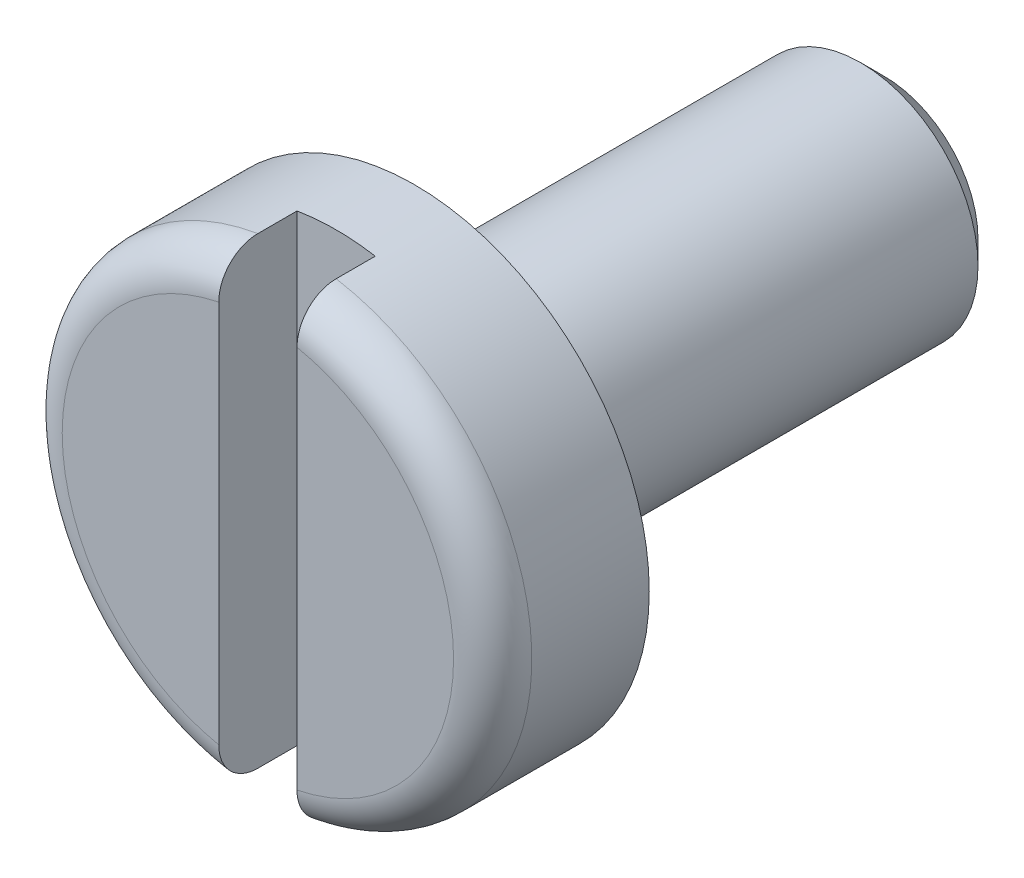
ISO-10303-21;
HEADER;
FILE_DESCRIPTION(('STEP AP214'),'2;1');
FILE_NAME('part.step','',(''),(''),'','','');
FILE_SCHEMA(('AUTOMOTIVE_DESIGN { 1 0 10303 214 1 1 1 1 }'));
ENDSEC;
DATA;
#1=APPLICATION_CONTEXT('core data for automotive mechanical design processes');
#2=APPLICATION_PROTOCOL_DEFINITION('international standard','automotive_design',2000,#1);
#3=PRODUCT_CONTEXT('',#1,'mechanical');
#4=PRODUCT('Part','Part','',(#3));
#5=PRODUCT_RELATED_PRODUCT_CATEGORY('part','',(#4));
#6=PRODUCT_DEFINITION_FORMATION('','',#4);
#7=PRODUCT_DEFINITION_CONTEXT('part definition',#1,'design');
#8=PRODUCT_DEFINITION('design','',#6,#7);
#9=PRODUCT_DEFINITION_SHAPE('','',#8);
#10=(LENGTH_UNIT() NAMED_UNIT(*) SI_UNIT(.MILLI.,.METRE.));
#11=(NAMED_UNIT(*) PLANE_ANGLE_UNIT() SI_UNIT($,.RADIAN.));
#12=(NAMED_UNIT(*) SI_UNIT($,.STERADIAN.) SOLID_ANGLE_UNIT());
#13=UNCERTAINTY_MEASURE_WITH_UNIT(LENGTH_MEASURE(1.E-05),#10,'distance_accuracy_value','');
#14=(GEOMETRIC_REPRESENTATION_CONTEXT(3) GLOBAL_UNCERTAINTY_ASSIGNED_CONTEXT((#13)) GLOBAL_UNIT_ASSIGNED_CONTEXT((#10,
#11,#12)) REPRESENTATION_CONTEXT('',''));
#15=CARTESIAN_POINT('',(0.,0.,0.));
#16=DIRECTION('',(0.,0.,1.));
#17=DIRECTION('',(1.,0.,0.));
#18=AXIS2_PLACEMENT_3D('',#15,#16,#17);
#19=CARTESIAN_POINT('',(0.,0.,8.));
#20=DIRECTION('',(0.,0.,1.));
#21=DIRECTION('',(1.,0.,0.));
#22=AXIS2_PLACEMENT_3D('',#19,#20,#21);
#23=PLANE('',#22);
#24=DIRECTION('',(0.,-1.,0.));
#25=VECTOR('',#24,1.);
#26=CARTESIAN_POINT('',(-0.5,3.22863713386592,8.));
#27=LINE('',#26,#25);
#28=CARTESIAN_POINT('',(-0.5,2.44948974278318,8.));
#29=VERTEX_POINT('',#28);
#30=CARTESIAN_POINT('',(-0.5,-2.44948974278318,8.));
#31=VERTEX_POINT('',#30);
#32=EDGE_CURVE('E80',#29,#31,#27,.T.);
#33=ORIENTED_EDGE('',*,*,#32,.F.);
#34=CARTESIAN_POINT('',(0.,0.,8.));
#35=DIRECTION('',(0.,0.,1.));
#36=DIRECTION('',(1.,0.,0.));
#37=AXIS2_PLACEMENT_3D('',#34,#35,#36);
#38=CIRCLE('',#37,2.5);
#39=EDGE_CURVE('E91',#29,#31,#38,.T.);
#40=ORIENTED_EDGE('',*,*,#39,.T.);
#41=EDGE_LOOP('',(#33,#40));
#42=FACE_BOUND('',#41,.T.);
#43=ADVANCED_FACE('F26',(#42),#23,.T.);
#44=CARTESIAN_POINT('',(0.,0.,7.5));
#45=DIRECTION('',(0.,0.,1.));
#46=DIRECTION('',(1.,0.,0.));
#47=AXIS2_PLACEMENT_3D('',#44,#45,#46);
#48=TOROIDAL_SURFACE('',#47,2.5,0.5);
#49=CARTESIAN_POINT('',(-0.5,-2.92910029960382,7.66648391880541));
#50=CARTESIAN_POINT('',(-0.5,-2.93844823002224,7.64038516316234));
#51=CARTESIAN_POINT('',(-0.5,-2.94560497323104,7.61348100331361));
#52=CARTESIAN_POINT('',(-0.5,-2.95530441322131,7.55883158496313));
#53=CARTESIAN_POINT('',(-0.5,-2.9578419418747,7.53108541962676));
#54=CARTESIAN_POINT('',(-0.5,-2.95821537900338,7.47557010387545));
#55=CARTESIAN_POINT('',(-0.5,-2.95605316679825,7.44780096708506));
#56=CARTESIAN_POINT('',(-0.5,-2.94709636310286,7.39302777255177));
#57=CARTESIAN_POINT('',(-0.5,-2.94030282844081,7.36602354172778));
#58=CARTESIAN_POINT('',(-0.5,-2.92229021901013,7.31353419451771));
#59=CARTESIAN_POINT('',(-0.5,-2.91107107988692,7.28804910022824));
#60=CARTESIAN_POINT('',(-0.5,-2.88454214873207,7.23930539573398));
#61=CARTESIAN_POINT('',(-0.5,-2.8692321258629,7.2160469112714));
#62=CARTESIAN_POINT('',(-0.5,-2.83484898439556,7.17223295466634));
#63=CARTESIAN_POINT('',(-0.5,-2.81574984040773,7.15169791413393));
#64=CARTESIAN_POINT('',(-0.5,-2.77441547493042,7.11407484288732));
#65=CARTESIAN_POINT('',(-0.5,-2.75218007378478,7.096987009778));
#66=CARTESIAN_POINT('',(-0.5,-2.70489167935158,7.06649491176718));
#67=CARTESIAN_POINT('',(-0.5,-2.67980509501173,7.05314275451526));
#68=CARTESIAN_POINT('',(-0.5,-2.62777294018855,7.03076231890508));
#69=CARTESIAN_POINT('',(-0.5,-2.60082721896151,7.02173439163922));
#70=CARTESIAN_POINT('',(-0.5,-2.5453693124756,7.00810295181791));
#71=CARTESIAN_POINT('',(-0.5,-2.51683867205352,7.00357451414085));
#72=CARTESIAN_POINT('',(-0.5,-2.45942117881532,6.99929807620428));
#73=CARTESIAN_POINT('',(-0.5,-2.43053429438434,6.99955050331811));
#74=CARTESIAN_POINT('',(-0.5,-2.37278535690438,7.00484798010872));
#75=CARTESIAN_POINT('',(-0.5,-2.34392957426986,7.00996155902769));
#76=CARTESIAN_POINT('',(-0.5,-2.2874751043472,7.02493432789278));
#77=CARTESIAN_POINT('',(-0.5,-2.25987649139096,7.03479379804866));
#78=CARTESIAN_POINT('',(-0.5,-2.20658588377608,7.05905829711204));
#79=CARTESIAN_POINT('',(-0.5,-2.18090412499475,7.0734858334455));
#80=CARTESIAN_POINT('',(-0.5,-2.13236000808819,7.10649188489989));
#81=CARTESIAN_POINT('',(-0.5,-2.10949757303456,7.12507028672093));
#82=CARTESIAN_POINT('',(-0.5,-2.06753180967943,7.16565875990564));
#83=CARTESIAN_POINT('',(-0.5,-2.04839034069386,7.18762935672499));
#84=CARTESIAN_POINT('',(-0.5,-2.0141846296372,7.23454496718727));
#85=CARTESIAN_POINT('',(-0.5,-1.99911975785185,7.25948952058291));
#86=CARTESIAN_POINT('',(-0.5,-1.97392316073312,7.31095624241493));
#87=CARTESIAN_POINT('',(-0.5,-1.96367361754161,7.33742071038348));
#88=CARTESIAN_POINT('',(-0.5,-1.94790406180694,7.39172254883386));
#89=CARTESIAN_POINT('',(-0.5,-1.94238316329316,7.41955966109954));
#90=CARTESIAN_POINT('',(-0.5,-1.93635623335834,7.47500517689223));
#91=CARTESIAN_POINT('',(-0.5,-1.93571821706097,7.50259929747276));
#92=CARTESIAN_POINT('',(-0.5,-1.93913162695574,7.55749434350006));
#93=CARTESIAN_POINT('',(-0.5,-1.94318271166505,7.58479529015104));
#94=CARTESIAN_POINT('',(-0.5,-1.95577233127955,7.63807658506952));
#95=CARTESIAN_POINT('',(-0.5,-1.96426975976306,7.66406667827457));
#96=CARTESIAN_POINT('',(-0.5,-1.98544238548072,7.71428359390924));
#97=CARTESIAN_POINT('',(-0.5,-1.99811784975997,7.73851030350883));
#98=CARTESIAN_POINT('',(-0.5,-2.02747185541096,7.78492736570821));
#99=CARTESIAN_POINT('',(-0.5,-2.04420914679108,7.80708052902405));
#100=CARTESIAN_POINT('',(-0.5,-2.08107095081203,7.84836082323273));
#101=CARTESIAN_POINT('',(-0.5,-2.10119592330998,7.86748754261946));
#102=CARTESIAN_POINT('',(-0.5,-2.14486992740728,7.90274203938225));
#103=CARTESIAN_POINT('',(-0.5,-2.16849950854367,7.91877004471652));
#104=CARTESIAN_POINT('',(-0.5,-2.21806540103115,7.94673839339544));
#105=CARTESIAN_POINT('',(-0.5,-2.24400201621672,7.95867819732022));
#106=CARTESIAN_POINT('',(-0.5,-2.29809760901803,7.97839941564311));
#107=CARTESIAN_POINT('',(-0.5,-2.32629423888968,7.98607768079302));
#108=CARTESIAN_POINT('',(-0.5,-2.38357319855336,7.99663397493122));
#109=CARTESIAN_POINT('',(-0.5,-2.41265558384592,7.99951170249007));
#110=CARTESIAN_POINT('',(-0.5,-2.47112566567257,8.00037745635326));
#111=CARTESIAN_POINT('',(-0.5,-2.50051395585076,7.99832656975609));
#112=CARTESIAN_POINT('',(-0.5,-2.55852063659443,7.98928463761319));
#113=CARTESIAN_POINT('',(-0.5,-2.58713907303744,7.98229388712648));
#114=CARTESIAN_POINT('',(-0.5,-2.64256911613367,7.96360640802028));
#115=CARTESIAN_POINT('',(-0.5,-2.66939218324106,7.95194370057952));
#116=CARTESIAN_POINT('',(-0.5,-2.72066329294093,7.92420874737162));
#117=CARTESIAN_POINT('',(-0.5,-2.7451109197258,7.90813573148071));
#118=CARTESIAN_POINT('',(-0.5,-2.79053500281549,7.87229330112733));
#119=CARTESIAN_POINT('',(-0.5,-2.81155761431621,7.85258232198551));
#120=CARTESIAN_POINT('',(-0.5,-2.84990593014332,7.80987278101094));
#121=CARTESIAN_POINT('',(-0.5,-2.86723646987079,7.78687858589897));
#122=CARTESIAN_POINT('',(-0.5,-2.89192637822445,7.74746372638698));
#123=CARTESIAN_POINT('',(-0.5,-2.90058016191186,7.73183834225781));
#124=CARTESIAN_POINT('',(-0.5,-2.91615865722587,7.69974783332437));
#125=CARTESIAN_POINT('',(-0.5,-2.92308338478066,7.68328271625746));
#126=CARTESIAN_POINT('',(-0.5,-2.92910029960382,7.66648391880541));
#127=B_SPLINE_CURVE_WITH_KNOTS('',3,(#49,#50,#51,#52,#53,#54,#55,#56,#57,#58,#59,#60,#61,#62,
#63,#64,#65,#66,#67,#68,#69,#70,#71,#72,#73,#74,#75,#76,#77,#78,#79,#80,#81,#82,#83,#84,#85,#86,
#87,#88,#89,#90,#91,#92,#93,#94,#95,#96,#97,#98,#99,#100,#101,#102,#103,#104,#105,#106,#107,
#108,#109,#110,#111,#112,#113,#114,#115,#116,#117,#118,#119,#120,#121,#122,#123,#124,#125,#126),
.UNSPECIFIED.,.T.,.F.,(4,2,2,2,2,2,2,2,2,2,2,2,2,2,2,2,2,2,2,2,2,2,2,2,2,2,2,2,2,2,2,2,2,2,2,2,
2,2,4),(0.,0.0831021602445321,0.166297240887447,0.249459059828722,0.332601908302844,
0.415745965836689,0.498894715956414,0.582635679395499,0.666381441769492,0.751242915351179,
0.836111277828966,0.922373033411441,1.00864250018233,1.09614645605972,1.18365557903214,
1.27160276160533,1.35954754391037,1.44653689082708,1.53351279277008,1.61823277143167,
1.70293687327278,1.7853430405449,1.86774320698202,1.94939470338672,2.03105141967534,
2.11396810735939,2.19689605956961,2.28216240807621,2.3674400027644,2.45470052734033,
2.54196653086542,2.62992378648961,2.71787578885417,2.80519864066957,2.89253675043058,
2.97857790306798,3.06450566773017,3.11799592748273,3.17148569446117),.UNSPECIFIED.);
#128=CARTESIAN_POINT('',(-0.5,-2.95803989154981,7.5));
#129=VERTEX_POINT('',#128);
#130=EDGE_CURVE('E49',#31,#129,#127,.T.);
#131=ORIENTED_EDGE('',*,*,#130,.F.);
#132=ORIENTED_EDGE('',*,*,#39,.F.);
#133=CARTESIAN_POINT('',(-0.5,1.96320130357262,7.65875486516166));
#134=CARTESIAN_POINT('',(-0.5,1.95429166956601,7.63296533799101));
#135=CARTESIAN_POINT('',(-0.5,1.94753561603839,7.60641313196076));
#136=CARTESIAN_POINT('',(-0.5,1.93857590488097,7.55253238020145));
#137=CARTESIAN_POINT('',(-0.5,1.93637654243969,7.52520312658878));
#138=CARTESIAN_POINT('',(-0.5,1.93661602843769,7.47057033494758));
#139=CARTESIAN_POINT('',(-0.5,1.93905361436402,7.44326679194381));
#140=CARTESIAN_POINT('',(-0.5,1.94847883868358,7.38946388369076));
#141=CARTESIAN_POINT('',(-0.5,1.95546570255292,7.36296438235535));
#142=CARTESIAN_POINT('',(-0.5,1.97375330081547,7.31148810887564));
#143=CARTESIAN_POINT('',(-0.5,1.98505592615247,7.28651200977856));
#144=CARTESIAN_POINT('',(-0.5,2.0116085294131,7.23875570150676));
#145=CARTESIAN_POINT('',(-0.5,2.02685897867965,7.21597575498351));
#146=CARTESIAN_POINT('',(-0.5,2.06121064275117,7.17272543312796));
#147=CARTESIAN_POINT('',(-0.5,2.08038762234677,7.15231526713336));
#148=CARTESIAN_POINT('',(-0.5,2.12181138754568,7.1148940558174));
#149=CARTESIAN_POINT('',(-0.5,2.14405861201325,7.09788349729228));
#150=CARTESIAN_POINT('',(-0.5,2.19167170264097,7.06724341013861));
#151=CARTESIAN_POINT('',(-0.5,2.21710813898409,7.05372349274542));
#152=CARTESIAN_POINT('',(-0.5,2.26985957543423,7.03105400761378));
#153=CARTESIAN_POINT('',(-0.5,2.29717478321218,7.02190492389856));
#154=CARTESIAN_POINT('',(-0.5,2.35346332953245,7.00808482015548));
#155=CARTESIAN_POINT('',(-0.5,2.38245820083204,7.00350132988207));
#156=CARTESIAN_POINT('',(-0.5,2.44080723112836,6.99925239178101));
#157=CARTESIAN_POINT('',(-0.5,2.47016140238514,6.9995871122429));
#158=CARTESIAN_POINT('',(-0.5,2.52847127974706,7.00519488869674));
#159=CARTESIAN_POINT('',(-0.5,2.55742578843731,7.01048044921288));
#160=CARTESIAN_POINT('',(-0.5,2.61401858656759,7.02589006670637));
#161=CARTESIAN_POINT('',(-0.5,2.64165693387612,7.03601391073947));
#162=CARTESIAN_POINT('',(-0.5,2.69451251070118,7.0607105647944));
#163=CARTESIAN_POINT('',(-0.5,2.71975232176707,7.07523501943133));
#164=CARTESIAN_POINT('',(-0.5,2.7673808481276,7.10838217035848));
#165=CARTESIAN_POINT('',(-0.5,2.78976980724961,7.12700451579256));
#166=CARTESIAN_POINT('',(-0.5,2.83066889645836,7.16749200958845));
#167=CARTESIAN_POINT('',(-0.5,2.84923655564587,7.18929904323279));
#168=CARTESIAN_POINT('',(-0.5,2.8823783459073,7.23576213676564));
#169=CARTESIAN_POINT('',(-0.5,2.89695283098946,7.26041794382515));
#170=CARTESIAN_POINT('',(-0.5,2.92146326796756,7.31146785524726));
#171=CARTESIAN_POINT('',(-0.5,2.93146727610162,7.33782929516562));
#172=CARTESIAN_POINT('',(-0.5,2.94685633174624,7.39186743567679));
#173=CARTESIAN_POINT('',(-0.5,2.95224167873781,7.41954405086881));
#174=CARTESIAN_POINT('',(-0.5,2.95819647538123,7.47512584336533));
#175=CARTESIAN_POINT('',(-0.5,2.95881418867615,7.50302586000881));
#176=CARTESIAN_POINT('',(-0.5,2.95534227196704,7.5585308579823));
#177=CARTESIAN_POINT('',(-0.5,2.95125277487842,7.58613584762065));
#178=CARTESIAN_POINT('',(-0.5,2.93850912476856,7.64018923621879));
#179=CARTESIAN_POINT('',(-0.5,2.92986767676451,7.66664063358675));
#180=CARTESIAN_POINT('',(-0.5,2.90828791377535,7.71772739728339));
#181=CARTESIAN_POINT('',(-0.5,2.89534954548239,7.74236274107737));
#182=CARTESIAN_POINT('',(-0.5,2.86548508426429,7.78925651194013));
#183=CARTESIAN_POINT('',(-0.5,2.84853944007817,7.81150248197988));
#184=CARTESIAN_POINT('',(-0.5,2.81119361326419,7.85287463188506));
#185=CARTESIAN_POINT('',(-0.5,2.79079326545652,7.87200066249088));
#186=CARTESIAN_POINT('',(-0.5,2.74686661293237,7.90683638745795));
#187=CARTESIAN_POINT('',(-0.5,2.72330642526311,7.92250334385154));
#188=CARTESIAN_POINT('',(-0.5,2.67392303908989,7.94973116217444));
#189=CARTESIAN_POINT('',(-0.5,2.64809966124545,7.96129169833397));
#190=CARTESIAN_POINT('',(-0.5,2.59448406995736,7.98017564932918));
#191=CARTESIAN_POINT('',(-0.5,2.5666670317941,7.98742857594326));
#192=CARTESIAN_POINT('',(-0.5,2.51021721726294,7.99724052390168));
#193=CARTESIAN_POINT('',(-0.5,2.48158436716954,7.99979911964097));
#194=CARTESIAN_POINT('',(-0.5,2.42383891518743,8.0001810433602));
#195=CARTESIAN_POINT('',(-0.5,2.39472580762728,7.99792975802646));
#196=CARTESIAN_POINT('',(-0.5,2.33727960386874,7.98861602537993));
#197=CARTESIAN_POINT('',(-0.5,2.30894653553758,7.98155340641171));
#198=CARTESIAN_POINT('',(-0.5,2.25361751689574,7.96272990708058));
#199=CARTESIAN_POINT('',(-0.5,2.22663487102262,7.95092987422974));
#200=CARTESIAN_POINT('',(-0.5,2.17503979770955,7.92293922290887));
#201=CARTESIAN_POINT('',(-0.5,2.15042797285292,7.90674749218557));
#202=CARTESIAN_POINT('',(-0.5,2.10444662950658,7.87050199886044));
#203=CARTESIAN_POINT('',(-0.5,2.08306063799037,7.8504691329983));
#204=CARTESIAN_POINT('',(-0.5,2.04407034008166,7.80703920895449));
#205=CARTESIAN_POINT('',(-0.5,2.02646096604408,7.78364673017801));
#206=CARTESIAN_POINT('',(-0.5,2.00121934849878,7.74318298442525));
#207=CARTESIAN_POINT('',(-0.5,1.99228793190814,7.72690768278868));
#208=CARTESIAN_POINT('',(-0.5,1.97630655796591,7.6934572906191));
#209=CARTESIAN_POINT('',(-0.5,1.96925656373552,7.67628221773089));
#210=CARTESIAN_POINT('',(-0.5,1.96320130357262,7.65875486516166));
#211=B_SPLINE_CURVE_WITH_KNOTS('',3,(#133,#134,#135,#136,#137,#138,#139,#140,#141,#142,#143,
#144,#145,#146,#147,#148,#149,#150,#151,#152,#153,#154,#155,#156,#157,#158,#159,#160,#161,#162,
#163,#164,#165,#166,#167,#168,#169,#170,#171,#172,#173,#174,#175,#176,#177,#178,#179,#180,#181,
#182,#183,#184,#185,#186,#187,#188,#189,#190,#191,#192,#193,#194,#195,#196,#197,#198,#199,#200,
#201,#202,#203,#204,#205,#206,#207,#208,#209,#210),.UNSPECIFIED.,.T.,.F.,(4,2,2,2,2,2,2,2,2,2,2,
2,2,2,2,2,2,2,2,2,2,2,2,2,2,2,2,2,2,2,2,2,2,2,2,2,2,2,4),(0.,0.0817887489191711,
0.163654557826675,0.245498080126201,0.327327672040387,0.409193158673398,0.491068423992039,
0.5747045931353,0.658352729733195,0.744373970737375,0.830404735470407,0.918054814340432,
1.00570789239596,1.09358295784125,1.18145415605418,1.26839281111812,1.35532402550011,
1.44083128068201,1.52633095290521,1.61051231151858,1.69468821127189,1.77801085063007,
1.86133113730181,1.9444200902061,2.02751007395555,2.11101413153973,2.19452218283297,
2.27901049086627,2.36350550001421,2.44934756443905,2.5351974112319,2.62238866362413,
2.70958302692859,2.79751335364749,2.88546597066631,2.97295302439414,3.0603219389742,
3.11590916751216,3.17149530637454),.UNSPECIFIED.);
#212=CARTESIAN_POINT('',(-0.5,2.95803989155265,7.49999999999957));
#213=VERTEX_POINT('',#212);
#214=EDGE_CURVE('E76',#213,#29,#211,.T.);
#215=ORIENTED_EDGE('',*,*,#214,.F.);
#216=CARTESIAN_POINT('',(0.,0.,7.5));
#217=DIRECTION('',(0.,0.,1.));
#218=DIRECTION('',(1.,0.,0.));
#219=AXIS2_PLACEMENT_3D('',#216,#217,#218);
#220=CIRCLE('',#219,3.);
#221=EDGE_CURVE('E98',#129,#213,#220,.F.);
#222=ORIENTED_EDGE('',*,*,#221,.F.);
#223=EDGE_LOOP('',(#131,#132,#215,#222));
#224=FACE_BOUND('',#223,.T.);
#225=ADVANCED_FACE('F93',(#224),#48,.T.);
#226=CARTESIAN_POINT('',(0.,0.,6.));
#227=DIRECTION('',(0.,0.,-1.));
#228=DIRECTION('',(-1.,0.,0.));
#229=AXIS2_PLACEMENT_3D('',#226,#227,#228);
#230=CYLINDRICAL_SURFACE('',#229,1.5);
#231=CARTESIAN_POINT('',(0.,0.,0.3));
#232=DIRECTION('',(0.,0.,1.));
#233=DIRECTION('',(1.,0.,0.));
#234=AXIS2_PLACEMENT_3D('',#231,#232,#233);
#235=CIRCLE('',#234,1.5);
#236=CARTESIAN_POINT('',(1.5,0.,0.3));
#237=VERTEX_POINT('',#236);
#238=EDGE_CURVE('E105',#237,#237,#235,.T.);
#239=ORIENTED_EDGE('',*,*,#238,.T.);
#240=EDGE_LOOP('',(#239));
#241=FACE_BOUND('',#240,.T.);
#242=CARTESIAN_POINT('',(0.,0.,6.));
#243=DIRECTION('',(0.,0.,1.));
#244=DIRECTION('',(1.,0.,0.));
#245=AXIS2_PLACEMENT_3D('',#242,#243,#244);
#246=CIRCLE('',#245,1.5);
#247=CARTESIAN_POINT('',(1.5,0.,6.));
#248=VERTEX_POINT('',#247);
#249=EDGE_CURVE('E101',#248,#248,#246,.T.);
#250=ORIENTED_EDGE('',*,*,#249,.F.);
#251=EDGE_LOOP('',(#250));
#252=FACE_BOUND('',#251,.T.);
#253=ADVANCED_FACE('F28',(#241,#252),#230,.T.);
#254=CARTESIAN_POINT('',(0.,0.,0.));
#255=DIRECTION('',(0.,0.,1.));
#256=DIRECTION('',(1.,0.,0.));
#257=AXIS2_PLACEMENT_3D('',#254,#255,#256);
#258=PLANE('',#257);
#259=CARTESIAN_POINT('',(0.,0.,0.));
#260=DIRECTION('',(0.,0.,1.));
#261=DIRECTION('',(1.,0.,0.));
#262=AXIS2_PLACEMENT_3D('',#259,#260,#261);
#263=CIRCLE('',#262,1.2);
#264=CARTESIAN_POINT('',(1.2,0.,0.));
#265=VERTEX_POINT('',#264);
#266=EDGE_CURVE('E108',#265,#265,#263,.F.);
#267=ORIENTED_EDGE('',*,*,#266,.T.);
#268=EDGE_LOOP('',(#267));
#269=FACE_BOUND('',#268,.T.);
#270=ADVANCED_FACE('F170',(#269),#258,.F.);
#271=CARTESIAN_POINT('',(0.,0.,6.));
#272=DIRECTION('',(0.,0.,1.));
#273=DIRECTION('',(1.,0.,0.));
#274=AXIS2_PLACEMENT_3D('',#271,#272,#273);
#275=PLANE('',#274);
#276=CARTESIAN_POINT('',(0.,0.,6.));
#277=DIRECTION('',(0.,0.,1.));
#278=DIRECTION('',(1.,0.,0.));
#279=AXIS2_PLACEMENT_3D('',#276,#277,#278);
#280=CIRCLE('',#279,3.);
#281=CARTESIAN_POINT('',(3.,0.,6.));
#282=VERTEX_POINT('',#281);
#283=EDGE_CURVE('E161',#282,#282,#280,.T.);
#284=ORIENTED_EDGE('',*,*,#283,.F.);
#285=EDGE_LOOP('',(#284));
#286=FACE_BOUND('',#285,.T.);
#287=ORIENTED_EDGE('',*,*,#249,.T.);
#288=EDGE_LOOP('',(#287));
#289=FACE_BOUND('',#288,.T.);
#290=ADVANCED_FACE('F167',(#286,#289),#275,.F.);
#291=CARTESIAN_POINT('',(0.,0.,8.));
#292=DIRECTION('',(0.,0.,-1.));
#293=DIRECTION('',(-1.,0.,0.));
#294=AXIS2_PLACEMENT_3D('',#291,#292,#293);
#295=CYLINDRICAL_SURFACE('',#294,3.);
#296=ORIENTED_EDGE('',*,*,#221,.T.);
#297=DIRECTION('',(0.,0.,-1.));
#298=VECTOR('',#297,1.);
#299=CARTESIAN_POINT('',(-0.5,2.95803989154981,8.));
#300=LINE('',#299,#298);
#301=CARTESIAN_POINT('',(-0.5,2.95803989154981,7.));
#302=VERTEX_POINT('',#301);
#303=EDGE_CURVE('E82',#213,#302,#300,.T.);
#304=ORIENTED_EDGE('',*,*,#303,.T.);
#305=CARTESIAN_POINT('',(0.,0.,7.));
#306=DIRECTION('',(0.,0.,1.));
#307=DIRECTION('',(1.,0.,0.));
#308=AXIS2_PLACEMENT_3D('',#305,#306,#307);
#309=CIRCLE('',#308,3.);
#310=CARTESIAN_POINT('',(0.5,2.95803989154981,7.));
#311=VERTEX_POINT('',#310);
#312=EDGE_CURVE('E11',#311,#302,#309,.T.);
#313=ORIENTED_EDGE('',*,*,#312,.F.);
#314=DIRECTION('',(0.,0.,-1.));
#315=VECTOR('',#314,1.);
#316=CARTESIAN_POINT('',(0.5,2.95803989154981,8.));
#317=LINE('',#316,#315);
#318=CARTESIAN_POINT('',(0.5,2.95803989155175,7.50000000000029));
#319=VERTEX_POINT('',#318);
#320=EDGE_CURVE('E151',#311,#319,#317,.F.);
#321=ORIENTED_EDGE('',*,*,#320,.T.);
#322=CARTESIAN_POINT('',(0.5,-2.95803989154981,7.5));
#323=VERTEX_POINT('',#322);
#324=EDGE_CURVE('E94',#319,#323,#220,.F.);
#325=ORIENTED_EDGE('',*,*,#324,.T.);
#326=DIRECTION('',(0.,0.,-1.));
#327=VECTOR('',#326,1.);
#328=CARTESIAN_POINT('',(0.5,-2.95803989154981,8.));
#329=LINE('',#328,#327);
#330=CARTESIAN_POINT('',(0.5,-2.95803989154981,7.));
#331=VERTEX_POINT('',#330);
#332=EDGE_CURVE('E148',#323,#331,#329,.T.);
#333=ORIENTED_EDGE('',*,*,#332,.T.);
#334=CARTESIAN_POINT('',(-0.5,-2.95803989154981,7.));
#335=VERTEX_POINT('',#334);
#336=EDGE_CURVE('E30',#335,#331,#309,.T.);
#337=ORIENTED_EDGE('',*,*,#336,.F.);
#338=DIRECTION('',(0.,0.,-1.));
#339=VECTOR('',#338,1.);
#340=CARTESIAN_POINT('',(-0.5,-2.95803989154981,8.));
#341=LINE('',#340,#339);
#342=EDGE_CURVE('E157',#335,#129,#341,.F.);
#343=ORIENTED_EDGE('',*,*,#342,.T.);
#344=EDGE_LOOP('',(#296,#304,#313,#321,#325,#333,#337,#343));
#345=FACE_BOUND('',#344,.T.);
#346=ORIENTED_EDGE('',*,*,#283,.T.);
#347=EDGE_LOOP('',(#346));
#348=FACE_BOUND('',#347,.T.);
#349=ADVANCED_FACE('F153',(#345,#348),#295,.T.);
#350=DIRECTION('',(0.,1.,0.));
#351=VECTOR('',#350,1.);
#352=CARTESIAN_POINT('',(0.5,3.22863713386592,8.));
#353=LINE('',#352,#351);
#354=CARTESIAN_POINT('',(0.5,-2.44948974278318,8.));
#355=VERTEX_POINT('',#354);
#356=CARTESIAN_POINT('',(0.5,2.44948974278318,8.));
#357=VERTEX_POINT('',#356);
#358=EDGE_CURVE('E41',#355,#357,#353,.T.);
#359=ORIENTED_EDGE('',*,*,#358,.F.);
#360=EDGE_CURVE('E95',#355,#357,#38,.T.);
#361=ORIENTED_EDGE('',*,*,#360,.T.);
#362=EDGE_LOOP('',(#359,#361));
#363=FACE_BOUND('',#362,.T.);
#364=ADVANCED_FACE('F180',(#363),#23,.T.);
#365=CARTESIAN_POINT('',(0.5,-2.92910029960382,7.66648391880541));
#366=CARTESIAN_POINT('',(0.5,-2.91964132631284,7.69288503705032));
#367=CARTESIAN_POINT('',(0.5,-2.90792578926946,7.71850082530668));
#368=CARTESIAN_POINT('',(0.5,-2.8803344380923,7.76741278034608));
#369=CARTESIAN_POINT('',(0.5,-2.86445319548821,7.79070586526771));
#370=CARTESIAN_POINT('',(0.5,-2.82902994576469,7.83428033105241));
#371=CARTESIAN_POINT('',(0.5,-2.80949170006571,7.85456476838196));
#372=CARTESIAN_POINT('',(0.5,-2.76732365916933,7.89159856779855));
#373=CARTESIAN_POINT('',(0.5,-2.74469460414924,7.9083487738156));
#374=CARTESIAN_POINT('',(0.5,-2.69674391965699,7.93804164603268));
#375=CARTESIAN_POINT('',(0.5,-2.67139724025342,7.95094384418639));
#376=CARTESIAN_POINT('',(0.5,-2.61892172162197,7.97238852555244));
#377=CARTESIAN_POINT('',(0.5,-2.5917926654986,7.98093047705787));
#378=CARTESIAN_POINT('',(0.5,-2.53604638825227,7.99355842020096));
#379=CARTESIAN_POINT('',(0.5,-2.50741201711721,7.99756871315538));
#380=CARTESIAN_POINT('',(0.5,-2.44987420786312,8.0007973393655));
#381=CARTESIAN_POINT('',(0.5,-2.42097074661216,8.00001525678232));
#382=CARTESIAN_POINT('',(0.5,-2.3632859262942,7.99365339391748));
#383=CARTESIAN_POINT('',(0.5,-2.33451194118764,7.98800660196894));
#384=CARTESIAN_POINT('',(0.5,-2.27831023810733,7.97198500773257));
#385=CARTESIAN_POINT('',(0.5,-2.25088259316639,7.96160994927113));
#386=CARTESIAN_POINT('',(0.5,-2.19804135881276,7.93635152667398));
#387=CARTESIAN_POINT('',(0.5,-2.1726368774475,7.92144908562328));
#388=CARTESIAN_POINT('',(0.5,-2.12472724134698,7.88754315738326));
#389=CARTESIAN_POINT('',(0.5,-2.10222199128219,7.86853980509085));
#390=CARTESIAN_POINT('',(0.5,-2.06105945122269,7.8271886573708));
#391=CARTESIAN_POINT('',(0.5,-2.04235981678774,7.80488305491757));
#392=CARTESIAN_POINT('',(0.5,-2.00909177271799,7.75737719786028));
#393=CARTESIAN_POINT('',(0.5,-1.99452269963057,7.7321774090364));
#394=CARTESIAN_POINT('',(0.5,-1.97035040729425,7.68031006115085));
#395=CARTESIAN_POINT('',(0.5,-1.96062590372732,7.653699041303));
#396=CARTESIAN_POINT('',(0.5,-1.94592120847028,7.59919763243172));
#397=CARTESIAN_POINT('',(0.5,-1.94094014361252,7.57130747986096));
#398=CARTESIAN_POINT('',(0.5,-1.93597179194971,7.51583610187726));
#399=CARTESIAN_POINT('',(0.5,-1.93585519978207,7.48826639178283));
#400=CARTESIAN_POINT('',(0.5,-1.94029294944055,7.43350713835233));
#401=CARTESIAN_POINT('',(0.5,-1.94484698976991,7.4063175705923));
#402=CARTESIAN_POINT('',(0.5,-1.95841203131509,7.35330125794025));
#403=CARTESIAN_POINT('',(0.5,-1.96738834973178,7.32746561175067));
#404=CARTESIAN_POINT('',(0.5,-1.98948180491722,7.27763195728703));
#405=CARTESIAN_POINT('',(0.5,-2.00259922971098,7.25363407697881));
#406=CARTESIAN_POINT('',(0.5,-2.03281257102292,7.20771789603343));
#407=CARTESIAN_POINT('',(0.5,-2.04997079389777,7.18584063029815));
#408=CARTESIAN_POINT('',(0.5,-2.0876232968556,7.14517634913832));
#409=CARTESIAN_POINT('',(0.5,-2.10811803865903,7.12638976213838));
#410=CARTESIAN_POINT('',(0.5,-2.15248558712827,7.09187845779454));
#411=CARTESIAN_POINT('',(0.5,-2.17643772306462,7.07625570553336));
#412=CARTESIAN_POINT('',(0.5,-2.22657930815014,7.04914823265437));
#413=CARTESIAN_POINT('',(0.5,-2.2527690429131,7.03766404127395));
#414=CARTESIAN_POINT('',(0.5,-2.30728145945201,7.01891183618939));
#415=CARTESIAN_POINT('',(0.5,-2.33563894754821,7.01174486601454));
#416=CARTESIAN_POINT('',(0.5,-2.39315261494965,7.00223556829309));
#417=CARTESIAN_POINT('',(0.5,-2.42230883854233,6.99989350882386));
#418=CARTESIAN_POINT('',(0.5,-2.4808084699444,7.0001146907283));
#419=CARTESIAN_POINT('',(0.5,-2.51015176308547,7.00271230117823));
#420=CARTESIAN_POINT('',(0.5,-2.56797691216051,7.01283567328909));
#421=CARTESIAN_POINT('',(0.5,-2.59645878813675,7.02036132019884));
#422=CARTESIAN_POINT('',(0.5,-2.65151082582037,7.04008257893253));
#423=CARTESIAN_POINT('',(0.5,-2.67809402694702,7.0522417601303));
#424=CARTESIAN_POINT('',(0.5,-2.72879636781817,7.08091882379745));
#425=CARTESIAN_POINT('',(0.5,-2.75291569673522,7.09743637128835));
#426=CARTESIAN_POINT('',(0.5,-2.79760223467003,7.13408886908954));
#427=CARTESIAN_POINT('',(0.5,-2.81821882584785,7.1541636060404));
#428=CARTESIAN_POINT('',(0.5,-2.8557199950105,7.19753891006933));
#429=CARTESIAN_POINT('',(0.5,-2.87260506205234,7.22083905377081));
#430=CARTESIAN_POINT('',(0.5,-2.90187742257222,7.26959326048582));
#431=CARTESIAN_POINT('',(0.5,-2.91433362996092,7.29500596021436));
#432=CARTESIAN_POINT('',(0.5,-2.93474709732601,7.34758655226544));
#433=CARTESIAN_POINT('',(0.5,-2.94270352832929,7.37475476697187));
#434=CARTESIAN_POINT('',(0.5,-2.95380269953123,7.42973196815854));
#435=CARTESIAN_POINT('',(0.5,-2.95699915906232,7.45753015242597));
#436=CARTESIAN_POINT('',(0.5,-2.95864736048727,7.51324267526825));
#437=CARTESIAN_POINT('',(0.5,-2.95710519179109,7.54115681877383));
#438=CARTESIAN_POINT('',(0.5,-2.95088464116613,7.58537362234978));
#439=CARTESIAN_POINT('',(0.5,-2.9476892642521,7.60189890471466));
#440=CARTESIAN_POINT('',(0.5,-2.93963316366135,7.6345382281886));
#441=CARTESIAN_POINT('',(0.5,-2.93477245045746,7.65065227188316));
#442=CARTESIAN_POINT('',(0.5,-2.92910029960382,7.66648391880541));
#443=B_SPLINE_CURVE_WITH_KNOTS('',3,(#365,#366,#367,#368,#369,#370,#371,#372,#373,#374,#375,
#376,#377,#378,#379,#380,#381,#382,#383,#384,#385,#386,#387,#388,#389,#390,#391,#392,#393,#394,
#395,#396,#397,#398,#399,#400,#401,#402,#403,#404,#405,#406,#407,#408,#409,#410,#411,#412,#413,
#414,#415,#416,#417,#418,#419,#420,#421,#422,#423,#424,#425,#426,#427,#428,#429,#430,#431,#432,
#433,#434,#435,#436,#437,#438,#439,#440,#441,#442),.UNSPECIFIED.,.T.,.F.,(4,2,2,2,2,2,2,2,2,2,2,
2,2,2,2,2,2,2,2,2,2,2,2,2,2,2,2,2,2,2,2,2,2,2,2,2,2,2,4),(0.,0.0840710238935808,
0.168252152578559,0.252347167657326,0.336422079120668,0.421352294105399,0.506292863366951,
0.592632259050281,0.678979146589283,0.766534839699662,0.854095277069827,0.94202990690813,
1.02996164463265,1.11685387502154,1.20373214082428,1.28830978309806,1.37287185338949,
1.45518465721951,1.53749214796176,1.61916415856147,1.7008418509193,1.78387258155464,
1.86691481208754,1.95231253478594,2.03772117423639,2.1250581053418,2.21239988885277,
2.30035160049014,2.38830126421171,2.47557324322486,2.56283851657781,2.64874747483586,
2.73464516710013,2.81914084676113,2.90365208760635,2.98720213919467,3.07064486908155,
3.12105906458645,3.17147294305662),.UNSPECIFIED.);
#444=EDGE_CURVE('E87',#323,#355,#443,.T.);
#445=ORIENTED_EDGE('',*,*,#444,.F.);
#446=ORIENTED_EDGE('',*,*,#324,.F.);
#447=CARTESIAN_POINT('',(0.5,1.96320130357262,7.65875486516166));
#448=CARTESIAN_POINT('',(0.5,1.97238651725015,7.68533381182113));
#449=CARTESIAN_POINT('',(0.5,1.98387354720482,7.71114216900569));
#450=CARTESIAN_POINT('',(0.5,2.01106078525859,7.76046527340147));
#451=CARTESIAN_POINT('',(0.5,2.02676729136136,7.78397651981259));
#452=CARTESIAN_POINT('',(0.5,2.06185144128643,7.82801193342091));
#453=CARTESIAN_POINT('',(0.5,2.08122280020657,7.84854110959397));
#454=CARTESIAN_POINT('',(0.5,2.12306559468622,7.8861318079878));
#455=CARTESIAN_POINT('',(0.5,2.14553630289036,7.90319414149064));
#456=CARTESIAN_POINT('',(0.5,2.19344831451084,7.93376093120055));
#457=CARTESIAN_POINT('',(0.5,2.21894209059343,7.94718314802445));
#458=CARTESIAN_POINT('',(0.5,2.27179274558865,7.96964943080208));
#459=CARTESIAN_POINT('',(0.5,2.29914990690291,7.97869283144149));
#460=CARTESIAN_POINT('',(0.5,2.35550256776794,7.99229245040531));
#461=CARTESIAN_POINT('',(0.5,2.38451915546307,7.9967614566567));
#462=CARTESIAN_POINT('',(0.5,2.44289212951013,8.00077841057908));
#463=CARTESIAN_POINT('',(0.5,2.47224852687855,8.00032619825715));
#464=CARTESIAN_POINT('',(0.5,2.53053732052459,7.99448367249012));
#465=CARTESIAN_POINT('',(0.5,2.55946856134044,7.98908178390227));
#466=CARTESIAN_POINT('',(0.5,2.61599512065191,7.97344457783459));
#467=CARTESIAN_POINT('',(0.5,2.64359050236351,7.96320948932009));
#468=CARTESIAN_POINT('',(0.5,2.69633892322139,7.93830127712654));
#469=CARTESIAN_POINT('',(0.5,2.72151498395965,7.92367693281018));
#470=CARTESIAN_POINT('',(0.5,2.76899982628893,7.89034223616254));
#471=CARTESIAN_POINT('',(0.5,2.79130884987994,7.87163222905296));
#472=CARTESIAN_POINT('',(0.5,2.83203504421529,7.83098626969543));
#473=CARTESIAN_POINT('',(0.5,2.85051005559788,7.8091082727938));
#474=CARTESIAN_POINT('',(0.5,2.88345597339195,7.76252022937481));
#475=CARTESIAN_POINT('',(0.5,2.89792723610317,7.73781043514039));
#476=CARTESIAN_POINT('',(0.5,2.92222604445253,7.68667080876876));
#477=CARTESIAN_POINT('',(0.5,2.93212157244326,7.66027326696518));
#478=CARTESIAN_POINT('',(0.5,2.94728950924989,7.60618193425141));
#479=CARTESIAN_POINT('',(0.5,2.95256221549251,7.57848822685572));
#480=CARTESIAN_POINT('',(0.5,2.9582924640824,7.52288954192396));
#481=CARTESIAN_POINT('',(0.5,2.9587979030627,7.49498949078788));
#482=CARTESIAN_POINT('',(0.5,2.95510349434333,7.4395032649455));
#483=CARTESIAN_POINT('',(0.5,2.95090377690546,7.41191708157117));
#484=CARTESIAN_POINT('',(0.5,2.93794475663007,7.35791677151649));
#485=CARTESIAN_POINT('',(0.5,2.92919772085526,7.33149969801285));
#486=CARTESIAN_POINT('',(0.5,2.90741439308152,7.28049854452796));
#487=CARTESIAN_POINT('',(0.5,2.89437804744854,7.25591448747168));
#488=CARTESIAN_POINT('',(0.5,2.86432621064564,7.20913671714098));
#489=CARTESIAN_POINT('',(0.5,2.84729087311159,7.18695575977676));
#490=CARTESIAN_POINT('',(0.5,2.80977790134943,7.14572734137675));
#491=CARTESIAN_POINT('',(0.5,2.78930009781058,7.12668003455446));
#492=CARTESIAN_POINT('',(0.5,2.74523045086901,7.09201288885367));
#493=CARTESIAN_POINT('',(0.5,2.7216046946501,7.0764361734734));
#494=CARTESIAN_POINT('',(0.5,2.67210606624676,7.04939831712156));
#495=CARTESIAN_POINT('',(0.5,2.64623301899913,7.03793749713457));
#496=CARTESIAN_POINT('',(0.5,2.59253367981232,7.01926105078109));
#497=CARTESIAN_POINT('',(0.5,2.56468279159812,7.01211614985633));
#498=CARTESIAN_POINT('',(0.5,2.50818362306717,7.00252455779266));
#499=CARTESIAN_POINT('',(0.5,2.47953527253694,7.00007828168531));
#500=CARTESIAN_POINT('',(0.5,2.42177910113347,6.99992424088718));
#501=CARTESIAN_POINT('',(0.5,2.39267106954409,7.00229082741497));
#502=CARTESIAN_POINT('',(0.5,2.3352531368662,7.01183338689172));
#503=CARTESIAN_POINT('',(0.5,2.30694329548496,7.01900971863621));
#504=CARTESIAN_POINT('',(0.5,2.25168069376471,7.03805723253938));
#505=CARTESIAN_POINT('',(0.5,2.2247413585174,7.04996741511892));
#506=CARTESIAN_POINT('',(0.5,2.17325852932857,7.0781666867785));
#507=CARTESIAN_POINT('',(0.5,2.14871504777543,7.0944557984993));
#508=CARTESIAN_POINT('',(0.5,2.10290048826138,7.13087368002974));
#509=CARTESIAN_POINT('',(0.5,2.08161076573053,7.15097896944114));
#510=CARTESIAN_POINT('',(0.5,2.04280361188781,7.1945503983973));
#511=CARTESIAN_POINT('',(0.5,2.02528557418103,7.21801599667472));
#512=CARTESIAN_POINT('',(0.5,1.99495972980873,7.26708423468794));
#513=CARTESIAN_POINT('',(0.5,1.98205436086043,7.29262654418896));
#514=CARTESIAN_POINT('',(0.5,1.96085847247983,7.34556768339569));
#515=CARTESIAN_POINT('',(0.5,1.95256826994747,7.37296664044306));
#516=CARTESIAN_POINT('',(0.5,1.94107541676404,7.42799686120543));
#517=CARTESIAN_POINT('',(0.5,1.93773523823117,7.45559953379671));
#518=CARTESIAN_POINT('',(0.5,1.93582628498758,7.51094405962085));
#519=CARTESIAN_POINT('',(0.5,1.9372508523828,7.53868566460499));
#520=CARTESIAN_POINT('',(0.5,1.94319054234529,7.58184438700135));
#521=CARTESIAN_POINT('',(0.5,1.94613683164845,7.5974937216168));
#522=CARTESIAN_POINT('',(0.5,1.95354354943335,7.62842922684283));
#523=CARTESIAN_POINT('',(0.5,1.95800393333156,7.64371540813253));
#524=CARTESIAN_POINT('',(0.5,1.96320130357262,7.65875486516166));
#525=B_SPLINE_CURVE_WITH_KNOTS('',3,(#447,#448,#449,#450,#451,#452,#453,#454,#455,#456,#457,
#458,#459,#460,#461,#462,#463,#464,#465,#466,#467,#468,#469,#470,#471,#472,#473,#474,#475,#476,
#477,#478,#479,#480,#481,#482,#483,#484,#485,#486,#487,#488,#489,#490,#491,#492,#493,#494,#495,
#496,#497,#498,#499,#500,#501,#502,#503,#504,#505,#506,#507,#508,#509,#510,#511,#512,#513,#514,
#515,#516,#517,#518,#519,#520,#521,#522,#523,#524),.UNSPECIFIED.,.T.,.F.,(4,2,2,2,2,2,2,2,2,2,2,
2,2,2,2,2,2,2,2,2,2,2,2,2,2,2,2,2,2,2,2,2,2,2,2,2,2,2,4),(0.,0.0843037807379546,
0.168734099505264,0.253020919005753,0.337287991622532,0.423324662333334,0.509374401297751,
0.597035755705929,0.68469996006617,0.772569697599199,0.860435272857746,0.947358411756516,
1.03427420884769,1.11976418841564,1.20524655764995,1.28941451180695,1.37357705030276,
1.45689309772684,1.54020683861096,1.62329698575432,1.70638817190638,1.78990078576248,
1.87341750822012,1.95792031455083,2.04242970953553,2.12828884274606,2.21415555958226,
2.30135885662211,2.38856865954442,2.47651236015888,2.5644565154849,2.65187614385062,
2.73928170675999,2.82471059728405,2.91014535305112,2.99315879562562,3.07605629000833,
3.1237602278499,3.17146276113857),.UNSPECIFIED.);
#526=EDGE_CURVE('E111',#357,#319,#525,.T.);
#527=ORIENTED_EDGE('',*,*,#526,.F.);
#528=ORIENTED_EDGE('',*,*,#360,.F.);
#529=EDGE_LOOP('',(#445,#446,#527,#528));
#530=FACE_BOUND('',#529,.T.);
#531=ADVANCED_FACE('F119',(#530),#48,.T.);
#532=CARTESIAN_POINT('',(0.,0.,0.3));
#533=DIRECTION('',(0.,0.,1.));
#534=DIRECTION('',(1.,0.,0.));
#535=AXIS2_PLACEMENT_3D('',#532,#533,#534);
#536=CONICAL_SURFACE('',#535,1.5,0.78539816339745);
#537=ORIENTED_EDGE('',*,*,#266,.F.);
#538=EDGE_LOOP('',(#537));
#539=FACE_BOUND('',#538,.T.);
#540=ORIENTED_EDGE('',*,*,#238,.F.);
#541=EDGE_LOOP('',(#540));
#542=FACE_BOUND('',#541,.T.);
#543=ADVANCED_FACE('F132',(#539,#542),#536,.T.);
#544=CARTESIAN_POINT('',(-0.5,-3.3817477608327,7.));
#545=DIRECTION('',(0.,0.,1.));
#546=DIRECTION('',(1.,0.,0.));
#547=AXIS2_PLACEMENT_3D('',#544,#545,#546);
#548=PLANE('',#547);
#549=ORIENTED_EDGE('',*,*,#312,.T.);
#550=DIRECTION('',(0.,-1.,0.));
#551=VECTOR('',#550,1.);
#552=CARTESIAN_POINT('',(-0.5,3.22863713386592,7.));
#553=LINE('',#552,#551);
#554=EDGE_CURVE('E145',#302,#335,#553,.T.);
#555=ORIENTED_EDGE('',*,*,#554,.T.);
#556=ORIENTED_EDGE('',*,*,#336,.T.);
#557=DIRECTION('',(0.,1.,0.));
#558=VECTOR('',#557,1.);
#559=CARTESIAN_POINT('',(0.5,3.22863713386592,7.));
#560=LINE('',#559,#558);
#561=EDGE_CURVE('E143',#331,#311,#560,.T.);
#562=ORIENTED_EDGE('',*,*,#561,.T.);
#563=EDGE_LOOP('',(#549,#555,#556,#562));
#564=FACE_BOUND('',#563,.T.);
#565=ADVANCED_FACE('F128',(#564),#548,.T.);
#566=CARTESIAN_POINT('',(-0.5,3.22863713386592,7.));
#567=DIRECTION('',(-1.,0.,0.));
#568=DIRECTION('',(0.,0.,1.));
#569=AXIS2_PLACEMENT_3D('',#566,#567,#568);
#570=PLANE('',#569);
#571=ORIENTED_EDGE('',*,*,#554,.F.);
#572=ORIENTED_EDGE('',*,*,#303,.F.);
#573=ORIENTED_EDGE('',*,*,#214,.T.);
#574=ORIENTED_EDGE('',*,*,#32,.T.);
#575=ORIENTED_EDGE('',*,*,#130,.T.);
#576=ORIENTED_EDGE('',*,*,#342,.F.);
#577=EDGE_LOOP('',(#571,#572,#573,#574,#575,#576));
#578=FACE_BOUND('',#577,.T.);
#579=ADVANCED_FACE('F79',(#578),#570,.F.);
#580=CARTESIAN_POINT('',(0.5,3.22863713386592,7.));
#581=DIRECTION('',(1.,0.,0.));
#582=DIRECTION('',(0.,0.,-1.));
#583=AXIS2_PLACEMENT_3D('',#580,#581,#582);
#584=PLANE('',#583);
#585=ORIENTED_EDGE('',*,*,#444,.T.);
#586=ORIENTED_EDGE('',*,*,#358,.T.);
#587=ORIENTED_EDGE('',*,*,#526,.T.);
#588=ORIENTED_EDGE('',*,*,#320,.F.);
#589=ORIENTED_EDGE('',*,*,#561,.F.);
#590=ORIENTED_EDGE('',*,*,#332,.F.);
#591=EDGE_LOOP('',(#585,#586,#587,#588,#589,#590));
#592=FACE_BOUND('',#591,.T.);
#593=ADVANCED_FACE('F123',(#592),#584,.F.);
#594=CLOSED_SHELL('',(#43,#225,#253,#270,#290,#349,#364,#531,#543,#565,#579,#593));
#595=MANIFOLD_SOLID_BREP('B2',#594);
#596=ADVANCED_BREP_SHAPE_REPRESENTATION('',(#18,#595),#14);
#597=SHAPE_DEFINITION_REPRESENTATION(#9,#596);
ENDSEC;
END-ISO-10303-21;
